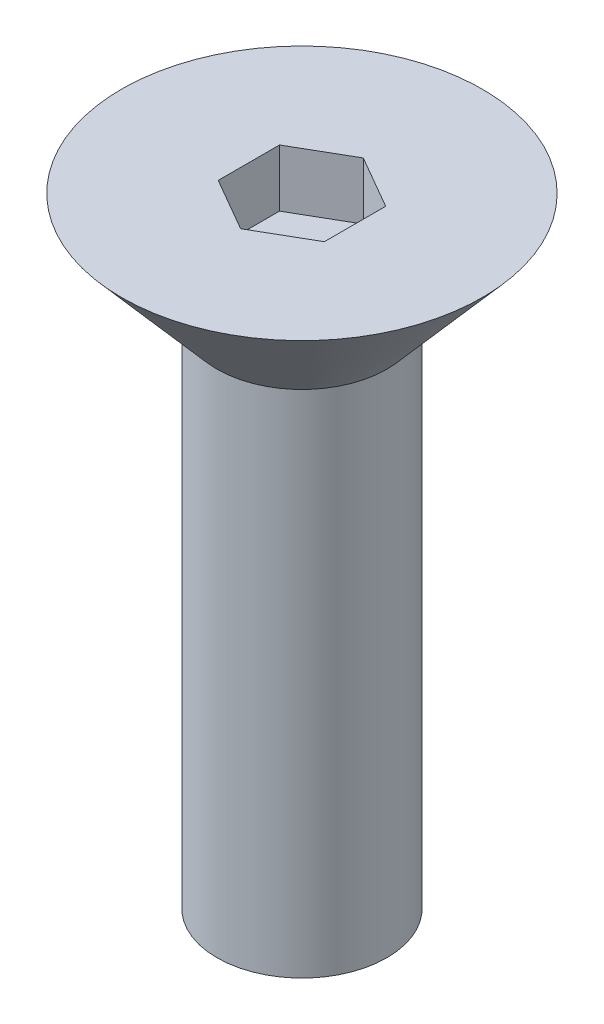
ISO-10303-21;
HEADER;
FILE_DESCRIPTION(('STEP AP214'),'2;1');
FILE_NAME('part.step','',(''),(''),'','','');
FILE_SCHEMA(('AUTOMOTIVE_DESIGN { 1 0 10303 214 1 1 1 1 }'));
ENDSEC;
DATA;
#1=APPLICATION_CONTEXT('core data for automotive mechanical design processes');
#2=APPLICATION_PROTOCOL_DEFINITION('international standard','automotive_design',2000,#1);
#3=PRODUCT_CONTEXT('',#1,'mechanical');
#4=PRODUCT('Part','Part','',(#3));
#5=PRODUCT_RELATED_PRODUCT_CATEGORY('part','',(#4));
#6=PRODUCT_DEFINITION_FORMATION('','',#4);
#7=PRODUCT_DEFINITION_CONTEXT('part definition',#1,'design');
#8=PRODUCT_DEFINITION('design','',#6,#7);
#9=PRODUCT_DEFINITION_SHAPE('','',#8);
#10=(LENGTH_UNIT() NAMED_UNIT(*) SI_UNIT(.MILLI.,.METRE.));
#11=(NAMED_UNIT(*) PLANE_ANGLE_UNIT() SI_UNIT($,.RADIAN.));
#12=(NAMED_UNIT(*) SI_UNIT($,.STERADIAN.) SOLID_ANGLE_UNIT());
#13=UNCERTAINTY_MEASURE_WITH_UNIT(LENGTH_MEASURE(1.E-05),#10,'distance_accuracy_value','');
#14=(GEOMETRIC_REPRESENTATION_CONTEXT(3) GLOBAL_UNCERTAINTY_ASSIGNED_CONTEXT((#13)) GLOBAL_UNIT_ASSIGNED_CONTEXT((#10,
#11,#12)) REPRESENTATION_CONTEXT('',''));
#15=CARTESIAN_POINT('',(0.,0.,0.));
#16=DIRECTION('',(0.,0.,1.));
#17=DIRECTION('',(1.,0.,0.));
#18=AXIS2_PLACEMENT_3D('',#15,#16,#17);
#19=CARTESIAN_POINT('',(-2.22044604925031E-13,-3.33066907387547E-13,3.10862446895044E-12));
#20=DIRECTION('',(0.,1.00000000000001,0.));
#21=DIRECTION('',(0.,0.,1.00000000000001));
#22=AXIS2_PLACEMENT_3D('',#19,#20,#21);
#23=PLANE('',#22);
#24=DIRECTION('',(0.,0.,1.00000000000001));
#25=VECTOR('',#24,1.);
#26=CARTESIAN_POINT('',(-1.98437500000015,-3.33066907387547E-13,-1.14567944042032));
#27=LINE('',#26,#25);
#28=CARTESIAN_POINT('',(-1.98437500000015,-3.33066907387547E-13,-1.14567944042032));
#29=VERTEX_POINT('',#28);
#30=CARTESIAN_POINT('',(-1.98437500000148,-3.33066907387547E-13,1.14567944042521));
#31=VERTEX_POINT('',#30);
#32=EDGE_CURVE('E49',#29,#31,#27,.T.);
#33=ORIENTED_EDGE('',*,*,#32,.F.);
#34=DIRECTION('',(-0.866025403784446,0.,0.500000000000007));
#35=VECTOR('',#34,1.);
#36=CARTESIAN_POINT('',(-1.4432899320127E-12,-3.33066907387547E-13,-2.29135888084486));
#37=LINE('',#36,#35);
#38=CARTESIAN_POINT('',(-1.4432899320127E-12,-3.33066907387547E-13,-2.29135888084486));
#39=VERTEX_POINT('',#38);
#40=EDGE_CURVE('E118',#39,#29,#37,.T.);
#41=ORIENTED_EDGE('',*,*,#40,.F.);
#42=DIRECTION('',(0.866025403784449,0.,0.500000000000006));
#43=VECTOR('',#42,1.);
#44=CARTESIAN_POINT('',(-1.4432899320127E-12,-3.33066907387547E-13,-2.29135888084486));
#45=LINE('',#44,#43);
#46=CARTESIAN_POINT('',(1.98437499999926,-3.33066907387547E-13,-1.14567944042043));
#47=VERTEX_POINT('',#46);
#48=EDGE_CURVE('E113',#39,#47,#45,.T.);
#49=ORIENTED_EDGE('',*,*,#48,.T.);
#50=DIRECTION('',(0.,0.,1.00000000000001));
#51=VECTOR('',#50,1.);
#52=CARTESIAN_POINT('',(1.98437499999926,-3.33066907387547E-13,-1.14567944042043));
#53=LINE('',#52,#51);
#54=CARTESIAN_POINT('',(1.98437499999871,-3.33066907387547E-13,1.14567944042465));
#55=VERTEX_POINT('',#54);
#56=EDGE_CURVE('E111',#47,#55,#53,.T.);
#57=ORIENTED_EDGE('',*,*,#56,.T.);
#58=DIRECTION('',(0.866025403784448,0.,-0.500000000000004));
#59=VECTOR('',#58,1.);
#60=CARTESIAN_POINT('',(-1.55431223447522E-12,-3.33066907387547E-13,2.2913588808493));
#61=LINE('',#60,#59);
#62=CARTESIAN_POINT('',(-1.55431223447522E-12,-3.33066907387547E-13,2.2913588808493));
#63=VERTEX_POINT('',#62);
#64=EDGE_CURVE('E94',#63,#55,#61,.T.);
#65=ORIENTED_EDGE('',*,*,#64,.F.);
#66=DIRECTION('',(-0.866025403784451,0.,-0.500000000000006));
#67=VECTOR('',#66,1.);
#68=CARTESIAN_POINT('',(-1.55431223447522E-12,-3.33066907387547E-13,2.2913588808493));
#69=LINE('',#68,#67);
#70=EDGE_CURVE('E104',#63,#31,#69,.T.);
#71=ORIENTED_EDGE('',*,*,#70,.T.);
#72=EDGE_LOOP('',(#33,#41,#49,#57,#65,#71));
#73=FACE_BOUND('',#72,.T.);
#74=CARTESIAN_POINT('',(-2.22044604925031E-13,-3.33066907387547E-13,3.10862446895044E-12));
#75=DIRECTION('',(0.,1.00000000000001,0.));
#76=DIRECTION('',(0.,0.,1.00000000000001));
#77=AXIS2_PLACEMENT_3D('',#74,#75,#76);
#78=CIRCLE('',#77,6.7437);
#79=CARTESIAN_POINT('',(-2.10065387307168E-13,-3.00579048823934E-13,6.74370000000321));
#80=VERTEX_POINT('',#79);
#81=EDGE_CURVE('E11',#80,#80,#78,.T.);
#82=ORIENTED_EDGE('',*,*,#81,.T.);
#83=EDGE_LOOP('',(#82));
#84=FACE_BOUND('',#83,.T.);
#85=ADVANCED_FACE('F34',(#73,#84),#23,.T.);
#86=CARTESIAN_POINT('',(-3.33066907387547E-13,-4.10531973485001,1.77635683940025E-12));
#87=DIRECTION('',(0.,1.00000000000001,0.));
#88=DIRECTION('',(0.,0.,1.00000000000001));
#89=AXIS2_PLACEMENT_3D('',#86,#87,#88);
#90=CONICAL_SURFACE('',#89,3.175,0.715584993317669);
#91=ORIENTED_EDGE('',*,*,#81,.F.);
#92=EDGE_LOOP('',(#91));
#93=FACE_BOUND('',#92,.T.);
#94=CARTESIAN_POINT('',(-3.33066907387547E-13,-4.10531973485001,1.77635683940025E-12));
#95=DIRECTION('',(0.,1.00000000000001,0.));
#96=DIRECTION('',(0.,0.,1.00000000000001));
#97=AXIS2_PLACEMENT_3D('',#94,#95,#96);
#98=CIRCLE('',#97,3.175);
#99=CARTESIAN_POINT('',(-3.27426974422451E-13,-4.10531973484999,3.17500000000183));
#100=VERTEX_POINT('',#99);
#101=EDGE_CURVE('E42',#100,#100,#98,.T.);
#102=ORIENTED_EDGE('',*,*,#101,.T.);
#103=EDGE_LOOP('',(#102));
#104=FACE_BOUND('',#103,.T.);
#105=ADVANCED_FACE('F145',(#93,#104),#90,.T.);
#106=CARTESIAN_POINT('',(-1.4432899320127E-12,25.3999999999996,2.77555756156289E-12));
#107=DIRECTION('',(0.,1.00000000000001,0.));
#108=DIRECTION('',(0.,0.,1.00000000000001));
#109=AXIS2_PLACEMENT_3D('',#106,#107,#108);
#110=CYLINDRICAL_SURFACE('',#109,3.17500000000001);
#111=CARTESIAN_POINT('',(-6.66133814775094E-13,-23.15531973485,1.88737914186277E-12));
#112=DIRECTION('',(0.,1.00000000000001,0.));
#113=DIRECTION('',(0.,0.,1.00000000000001));
#114=AXIS2_PLACEMENT_3D('',#111,#112,#113);
#115=CIRCLE('',#114,3.17500000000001);
#116=CARTESIAN_POINT('',(-6.60493881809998E-13,-23.15531973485,3.17500000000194));
#117=VERTEX_POINT('',#116);
#118=EDGE_CURVE('E134',#117,#117,#115,.T.);
#119=ORIENTED_EDGE('',*,*,#118,.T.);
#120=EDGE_LOOP('',(#119));
#121=FACE_BOUND('',#120,.T.);
#122=ORIENTED_EDGE('',*,*,#101,.F.);
#123=EDGE_LOOP('',(#122));
#124=FACE_BOUND('',#123,.T.);
#125=ADVANCED_FACE('F147',(#121,#124),#110,.T.);
#126=CARTESIAN_POINT('',(3.17499999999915,-23.15531973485,2.22044604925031E-12));
#127=DIRECTION('',(0.,-1.00000000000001,0.));
#128=DIRECTION('',(0.,0.,-1.00000000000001));
#129=AXIS2_PLACEMENT_3D('',#126,#127,#128);
#130=PLANE('',#129);
#131=ORIENTED_EDGE('',*,*,#118,.F.);
#132=EDGE_LOOP('',(#131));
#133=FACE_BOUND('',#132,.T.);
#134=ADVANCED_FACE('F149',(#133),#130,.T.);
#135=CARTESIAN_POINT('',(-1.98437500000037,-2.14122000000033,-1.14567944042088));
#136=DIRECTION('',(-1.00000000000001,0.,0.));
#137=DIRECTION('',(0.,0.,1.00000000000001));
#138=AXIS2_PLACEMENT_3D('',#135,#136,#137);
#139=PLANE('',#138);
#140=ORIENTED_EDGE('',*,*,#32,.T.);
#141=DIRECTION('',(0.,1.00000000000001,0.));
#142=VECTOR('',#141,1.);
#143=CARTESIAN_POINT('',(-1.98437500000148,-2.14122000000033,1.14567944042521));
#144=LINE('',#143,#142);
#145=CARTESIAN_POINT('',(-1.98437500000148,-2.14122000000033,1.14567944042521));
#146=VERTEX_POINT('',#145);
#147=EDGE_CURVE('E101',#146,#31,#144,.T.);
#148=ORIENTED_EDGE('',*,*,#147,.F.);
#149=DIRECTION('',(0.,0.,1.00000000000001));
#150=VECTOR('',#149,1.);
#151=CARTESIAN_POINT('',(-1.98437500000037,-2.14122000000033,-1.14567944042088));
#152=LINE('',#151,#150);
#153=CARTESIAN_POINT('',(-1.98437500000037,-2.14122000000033,-1.14567944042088));
#154=VERTEX_POINT('',#153);
#155=EDGE_CURVE('E120',#154,#146,#152,.T.);
#156=ORIENTED_EDGE('',*,*,#155,.F.);
#157=DIRECTION('',(0.,1.00000000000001,0.));
#158=VECTOR('',#157,1.);
#159=CARTESIAN_POINT('',(-1.98437500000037,-2.14122000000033,-1.14567944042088));
#160=LINE('',#159,#158);
#161=EDGE_CURVE('E56',#154,#29,#160,.T.);
#162=ORIENTED_EDGE('',*,*,#161,.T.);
#163=EDGE_LOOP('',(#140,#148,#156,#162));
#164=FACE_BOUND('',#163,.T.);
#165=ADVANCED_FACE('F156',(#164),#139,.F.);
#166=CARTESIAN_POINT('',(-5.55111512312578E-13,-2.14122000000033,-2.29135888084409));
#167=DIRECTION('',(-0.500000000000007,0.,-0.866025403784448));
#168=DIRECTION('',(-0.866025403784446,0.,0.500000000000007));
#169=AXIS2_PLACEMENT_3D('',#166,#167,#168);
#170=PLANE('',#169);
#171=ORIENTED_EDGE('',*,*,#40,.T.);
#172=ORIENTED_EDGE('',*,*,#161,.F.);
#173=DIRECTION('',(-0.866025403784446,0.,0.500000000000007));
#174=VECTOR('',#173,1.);
#175=CARTESIAN_POINT('',(-5.55111512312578E-13,-2.14122000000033,-2.29135888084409));
#176=LINE('',#175,#174);
#177=CARTESIAN_POINT('',(-5.55111512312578E-13,-2.14122000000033,-2.29135888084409));
#178=VERTEX_POINT('',#177);
#179=EDGE_CURVE('E130',#178,#154,#176,.T.);
#180=ORIENTED_EDGE('',*,*,#179,.F.);
#181=DIRECTION('',(0.,1.00000000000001,0.));
#182=VECTOR('',#181,1.);
#183=CARTESIAN_POINT('',(-5.55111512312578E-13,-2.14122000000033,-2.29135888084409));
#184=LINE('',#183,#182);
#185=EDGE_CURVE('E135',#178,#39,#184,.T.);
#186=ORIENTED_EDGE('',*,*,#185,.T.);
#187=EDGE_LOOP('',(#171,#172,#180,#186));
#188=FACE_BOUND('',#187,.T.);
#189=ADVANCED_FACE('F189',(#188),#170,.F.);
#190=CARTESIAN_POINT('',(-5.55111512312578E-13,-2.14122000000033,-2.29135888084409));
#191=DIRECTION('',(-0.500000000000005,0.,0.866025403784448));
#192=DIRECTION('',(0.866025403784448,0.,0.500000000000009));
#193=AXIS2_PLACEMENT_3D('',#190,#191,#192);
#194=PLANE('',#193);
#195=ORIENTED_EDGE('',*,*,#48,.F.);
#196=ORIENTED_EDGE('',*,*,#185,.F.);
#197=DIRECTION('',(0.866025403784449,0.,0.500000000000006));
#198=VECTOR('',#197,1.);
#199=CARTESIAN_POINT('',(-5.55111512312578E-13,-2.14122000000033,-2.29135888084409));
#200=LINE('',#199,#198);
#201=CARTESIAN_POINT('',(1.98437499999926,-2.14122000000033,-1.14567944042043));
#202=VERTEX_POINT('',#201);
#203=EDGE_CURVE('E128',#178,#202,#200,.T.);
#204=ORIENTED_EDGE('',*,*,#203,.T.);
#205=DIRECTION('',(0.,1.00000000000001,0.));
#206=VECTOR('',#205,1.);
#207=CARTESIAN_POINT('',(1.98437499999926,-2.14122000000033,-1.14567944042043));
#208=LINE('',#207,#206);
#209=EDGE_CURVE('E137',#202,#47,#208,.T.);
#210=ORIENTED_EDGE('',*,*,#209,.T.);
#211=EDGE_LOOP('',(#195,#196,#204,#210));
#212=FACE_BOUND('',#211,.T.);
#213=ADVANCED_FACE('F198',(#212),#194,.T.);
#214=CARTESIAN_POINT('',(1.98437499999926,-2.14122000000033,-1.14567944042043));
#215=DIRECTION('',(-1.00000000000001,0.,0.));
#216=DIRECTION('',(0.,0.,1.00000000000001));
#217=AXIS2_PLACEMENT_3D('',#214,#215,#216);
#218=PLANE('',#217);
#219=ORIENTED_EDGE('',*,*,#56,.F.);
#220=ORIENTED_EDGE('',*,*,#209,.F.);
#221=DIRECTION('',(0.,0.,1.00000000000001));
#222=VECTOR('',#221,1.);
#223=CARTESIAN_POINT('',(1.98437499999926,-2.14122000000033,-1.14567944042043));
#224=LINE('',#223,#222);
#225=CARTESIAN_POINT('',(1.98437499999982,-2.14122000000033,1.14567944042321));
#226=VERTEX_POINT('',#225);
#227=EDGE_CURVE('E126',#202,#226,#224,.T.);
#228=ORIENTED_EDGE('',*,*,#227,.T.);
#229=DIRECTION('',(0.,1.00000000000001,0.));
#230=VECTOR('',#229,1.);
#231=CARTESIAN_POINT('',(1.98437499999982,-2.14122000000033,1.14567944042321));
#232=LINE('',#231,#230);
#233=EDGE_CURVE('E100',#226,#55,#232,.T.);
#234=ORIENTED_EDGE('',*,*,#233,.T.);
#235=EDGE_LOOP('',(#219,#220,#228,#234));
#236=FACE_BOUND('',#235,.T.);
#237=ADVANCED_FACE('F207',(#236),#218,.T.);
#238=CARTESIAN_POINT('',(-1.4432899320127E-12,-2.14122000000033,2.2913588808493));
#239=DIRECTION('',(0.500000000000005,0.,0.866025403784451));
#240=DIRECTION('',(0.866025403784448,0.,-0.500000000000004));
#241=AXIS2_PLACEMENT_3D('',#238,#239,#240);
#242=PLANE('',#241);
#243=ORIENTED_EDGE('',*,*,#64,.T.);
#244=ORIENTED_EDGE('',*,*,#233,.F.);
#245=DIRECTION('',(0.866025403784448,0.,-0.500000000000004));
#246=VECTOR('',#245,1.);
#247=CARTESIAN_POINT('',(-1.4432899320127E-12,-2.14122000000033,2.2913588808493));
#248=LINE('',#247,#246);
#249=CARTESIAN_POINT('',(-1.4432899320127E-12,-2.14122000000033,2.2913588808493));
#250=VERTEX_POINT('',#249);
#251=EDGE_CURVE('E97',#250,#226,#248,.T.);
#252=ORIENTED_EDGE('',*,*,#251,.F.);
#253=DIRECTION('',(0.,1.00000000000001,0.));
#254=VECTOR('',#253,1.);
#255=CARTESIAN_POINT('',(-1.4432899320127E-12,-2.14122000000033,2.2913588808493));
#256=LINE('',#255,#254);
#257=EDGE_CURVE('E89',#250,#63,#256,.T.);
#258=ORIENTED_EDGE('',*,*,#257,.T.);
#259=EDGE_LOOP('',(#243,#244,#252,#258));
#260=FACE_BOUND('',#259,.T.);
#261=ADVANCED_FACE('F91',(#260),#242,.F.);
#262=CARTESIAN_POINT('',(-1.4432899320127E-12,-2.14122000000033,2.2913588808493));
#263=DIRECTION('',(0.500000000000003,0.,-0.86602540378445));
#264=DIRECTION('',(-0.866025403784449,0.,-0.500000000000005));
#265=AXIS2_PLACEMENT_3D('',#262,#263,#264);
#266=PLANE('',#265);
#267=ORIENTED_EDGE('',*,*,#70,.F.);
#268=ORIENTED_EDGE('',*,*,#257,.F.);
#269=DIRECTION('',(-0.866025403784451,0.,-0.500000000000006));
#270=VECTOR('',#269,1.);
#271=CARTESIAN_POINT('',(-1.4432899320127E-12,-2.14122000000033,2.2913588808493));
#272=LINE('',#271,#270);
#273=EDGE_CURVE('E123',#250,#146,#272,.T.);
#274=ORIENTED_EDGE('',*,*,#273,.T.);
#275=ORIENTED_EDGE('',*,*,#147,.T.);
#276=EDGE_LOOP('',(#267,#268,#274,#275));
#277=FACE_BOUND('',#276,.T.);
#278=ADVANCED_FACE('F105',(#277),#266,.T.);
#279=CARTESIAN_POINT('',(-1.98437500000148,-2.14122000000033,1.14567944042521));
#280=DIRECTION('',(0.,-1.00000000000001,0.));
#281=DIRECTION('',(0.,0.,-1.00000000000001));
#282=AXIS2_PLACEMENT_3D('',#279,#280,#281);
#283=PLANE('',#282);
#284=ORIENTED_EDGE('',*,*,#155,.T.);
#285=ORIENTED_EDGE('',*,*,#273,.F.);
#286=ORIENTED_EDGE('',*,*,#251,.T.);
#287=ORIENTED_EDGE('',*,*,#227,.F.);
#288=ORIENTED_EDGE('',*,*,#203,.F.);
#289=ORIENTED_EDGE('',*,*,#179,.T.);
#290=EDGE_LOOP('',(#284,#285,#286,#287,#288,#289));
#291=FACE_BOUND('',#290,.T.);
#292=ADVANCED_FACE('F234',(#291),#283,.F.);
#293=CLOSED_SHELL('',(#85,#105,#125,#134,#165,#189,#213,#237,#261,#278,#292));
#294=MANIFOLD_SOLID_BREP('B2',#293);
#295=ADVANCED_BREP_SHAPE_REPRESENTATION('',(#18,#294),#14);
#296=SHAPE_DEFINITION_REPRESENTATION(#9,#295);
ENDSEC;
END-ISO-10303-21;
